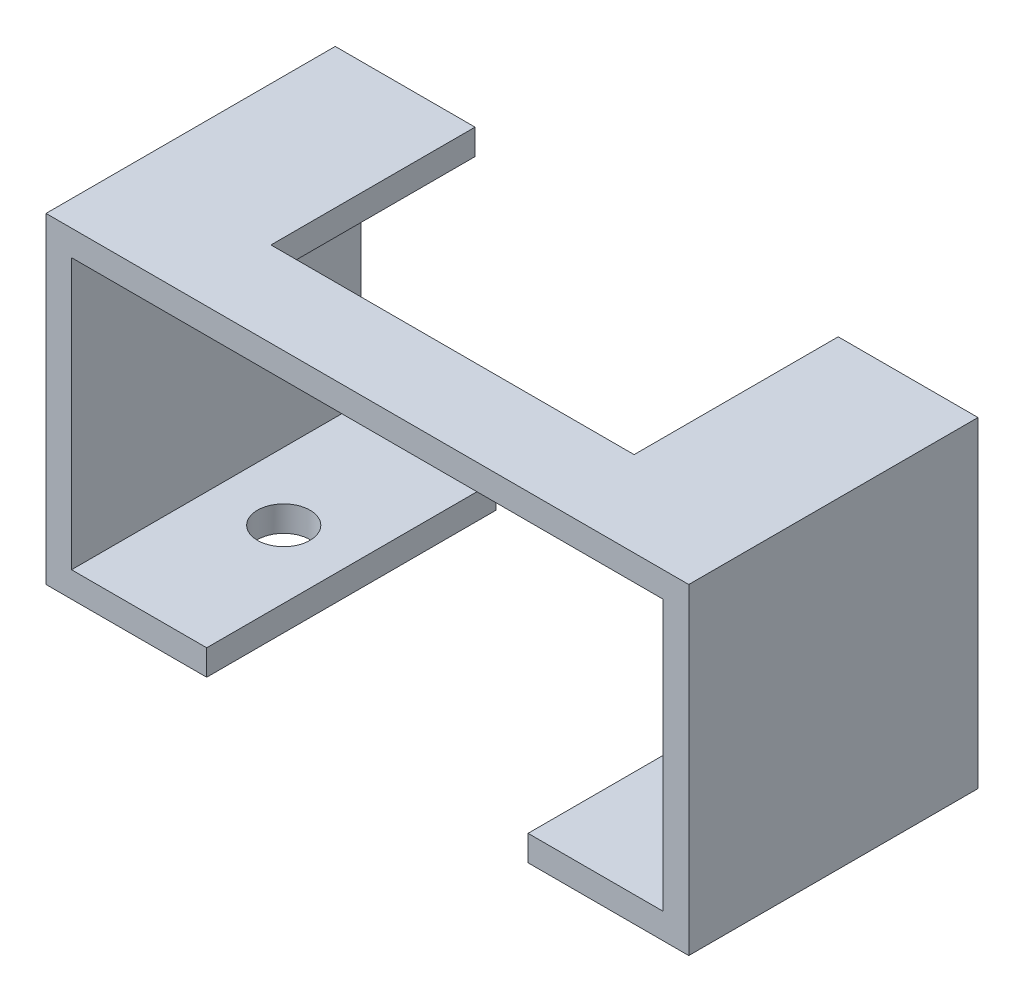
from build123d import *

# Parameters (mm, degrees)
BOSS_EXTRUDE1_DEPTH       = 18
SKETCH2_W                 = 22.6
SKETCH2_H                 = 12.7
CUT_EXTRUDE1_DEPTH        = 10
F_4_CLEARANCE_HOLE3_D     = 3.2639
F_4_CLEARANCE_HOLE3_DEPTH = 1.59


with BuildPart() as part:
    # Sketch1 → Boss-Extrude1 (new body)
    with BuildSketch(Plane.XY):
        Polygon((10, -20), (0, -20), (0, 0), (40, 0), (40, -20), (30, -20), (30, -18.41), (38.41, -18.41), (38.41, -1.59), (1.59, -1.59), (1.59, -18.41), (10, -18.41), align=None)
    extrude(amount=BOSS_EXTRUDE1_DEPTH)

    # Sketch2 → Cut-Extrude1 (cut)
    with BuildSketch(Plane(origin=(0, 0, 0), x_dir=(1, 0, 0), z_dir=(0, 1, 0))):
        with Locations((20, -6.35)):
            Rectangle(SKETCH2_W, SKETCH2_H)
    extrude(amount=-CUT_EXTRUDE1_DEPTH, mode=Mode.SUBTRACT)

    # 4 Clearance Hole3
    with Locations(Plane(origin=(0, -18.41, 0), x_dir=(1, 0, 0), z_dir=(0, 1, 0))):
        with Locations((5.795, -9), (34.205, -9)):
            Hole(F_4_CLEARANCE_HOLE3_D / 2, depth=F_4_CLEARANCE_HOLE3_DEPTH)


solid = part.part
